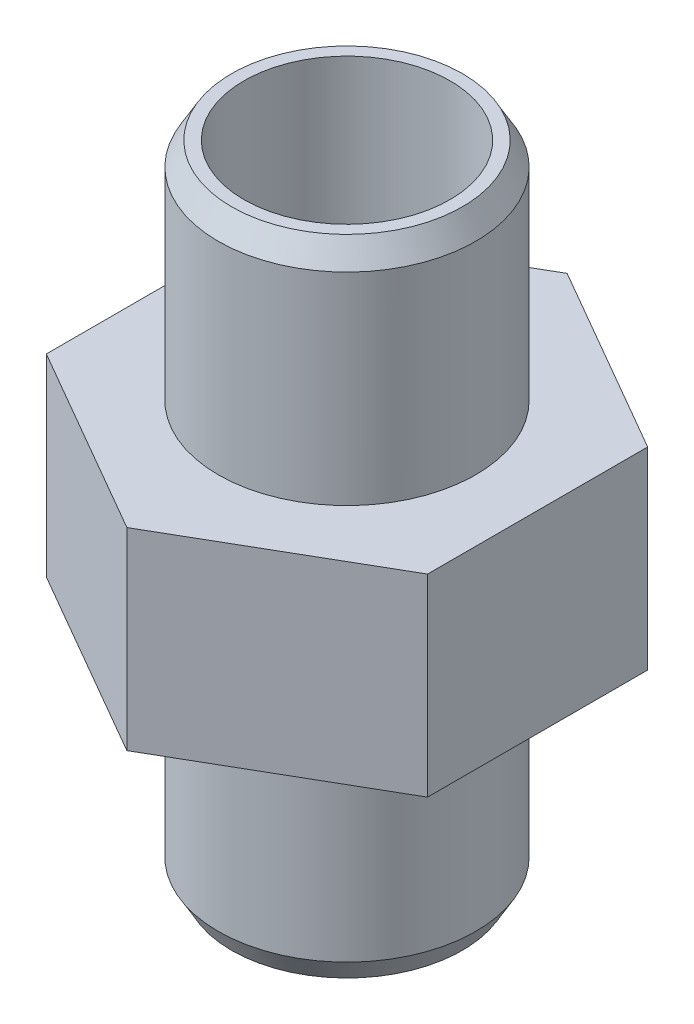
ISO-10303-21;
HEADER;
FILE_DESCRIPTION(('STEP AP214'),'2;1');
FILE_NAME('part.step','',(''),(''),'','','');
FILE_SCHEMA(('AUTOMOTIVE_DESIGN { 1 0 10303 214 1 1 1 1 }'));
ENDSEC;
DATA;
#1=APPLICATION_CONTEXT('core data for automotive mechanical design processes');
#2=APPLICATION_PROTOCOL_DEFINITION('international standard','automotive_design',2000,#1);
#3=PRODUCT_CONTEXT('',#1,'mechanical');
#4=PRODUCT('Part','Part','',(#3));
#5=PRODUCT_RELATED_PRODUCT_CATEGORY('part','',(#4));
#6=PRODUCT_DEFINITION_FORMATION('','',#4);
#7=PRODUCT_DEFINITION_CONTEXT('part definition',#1,'design');
#8=PRODUCT_DEFINITION('design','',#6,#7);
#9=PRODUCT_DEFINITION_SHAPE('','',#8);
#10=(LENGTH_UNIT() NAMED_UNIT(*) SI_UNIT(.MILLI.,.METRE.));
#11=(NAMED_UNIT(*) PLANE_ANGLE_UNIT() SI_UNIT($,.RADIAN.));
#12=(NAMED_UNIT(*) SI_UNIT($,.STERADIAN.) SOLID_ANGLE_UNIT());
#13=UNCERTAINTY_MEASURE_WITH_UNIT(LENGTH_MEASURE(1.E-05),#10,'distance_accuracy_value','');
#14=(GEOMETRIC_REPRESENTATION_CONTEXT(3) GLOBAL_UNCERTAINTY_ASSIGNED_CONTEXT((#13)) GLOBAL_UNIT_ASSIGNED_CONTEXT((#10,
#11,#12)) REPRESENTATION_CONTEXT('',''));
#15=CARTESIAN_POINT('',(0.,0.,0.));
#16=DIRECTION('',(0.,0.,1.));
#17=DIRECTION('',(1.,0.,0.));
#18=AXIS2_PLACEMENT_3D('',#15,#16,#17);
#19=CARTESIAN_POINT('',(6.35,4.7625,0.));
#20=DIRECTION('',(0.,-1.,0.));
#21=DIRECTION('',(0.,0.,-1.));
#22=AXIS2_PLACEMENT_3D('',#19,#20,#21);
#23=PLANE('',#22);
#24=CARTESIAN_POINT('',(0.,4.7625,0.));
#25=DIRECTION('',(0.,1.,0.));
#26=DIRECTION('',(0.,0.,1.));
#27=AXIS2_PLACEMENT_3D('',#24,#25,#26);
#28=CIRCLE('',#27,6.35);
#29=CARTESIAN_POINT('',(0.,4.7625,6.35));
#30=VERTEX_POINT('',#29);
#31=EDGE_CURVE('E130',#30,#30,#28,.T.);
#32=ORIENTED_EDGE('',*,*,#31,.F.);
#33=EDGE_LOOP('',(#32));
#34=FACE_BOUND('',#33,.T.);
#35=DIRECTION('',(0.866025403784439,0.,0.5));
#36=VECTOR('',#35,1.);
#37=CARTESIAN_POINT('',(-9.398,4.7625,5.4259378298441));
#38=LINE('',#37,#36);
#39=CARTESIAN_POINT('',(-9.398,4.7625,5.4259378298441));
#40=VERTEX_POINT('',#39);
#41=CARTESIAN_POINT('',(0.,4.7625,10.8518756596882));
#42=VERTEX_POINT('',#41);
#43=EDGE_CURVE('E106',#40,#42,#38,.T.);
#44=ORIENTED_EDGE('',*,*,#43,.T.);
#45=DIRECTION('',(0.866025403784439,0.,-0.5));
#46=VECTOR('',#45,1.);
#47=CARTESIAN_POINT('',(0.,4.7625,10.8518756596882));
#48=LINE('',#47,#46);
#49=CARTESIAN_POINT('',(9.398,4.7625,5.4259378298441));
#50=VERTEX_POINT('',#49);
#51=EDGE_CURVE('E104',#42,#50,#48,.T.);
#52=ORIENTED_EDGE('',*,*,#51,.T.);
#53=DIRECTION('',(0.,0.,-1.));
#54=VECTOR('',#53,1.);
#55=CARTESIAN_POINT('',(9.398,4.7625,5.4259378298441));
#56=LINE('',#55,#54);
#57=CARTESIAN_POINT('',(9.398,4.7625,-5.4259378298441));
#58=VERTEX_POINT('',#57);
#59=EDGE_CURVE('E46',#50,#58,#56,.T.);
#60=ORIENTED_EDGE('',*,*,#59,.T.);
#61=DIRECTION('',(-0.866025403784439,0.,-0.5));
#62=VECTOR('',#61,1.);
#63=CARTESIAN_POINT('',(9.398,4.7625,-5.4259378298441));
#64=LINE('',#63,#62);
#65=CARTESIAN_POINT('',(0.,4.7625,-10.8518756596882));
#66=VERTEX_POINT('',#65);
#67=EDGE_CURVE('E94',#58,#66,#64,.T.);
#68=ORIENTED_EDGE('',*,*,#67,.T.);
#69=DIRECTION('',(-0.866025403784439,0.,0.5));
#70=VECTOR('',#69,1.);
#71=CARTESIAN_POINT('',(0.,4.7625,-10.8518756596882));
#72=LINE('',#71,#70);
#73=CARTESIAN_POINT('',(-9.398,4.7625,-5.42593782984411));
#74=VERTEX_POINT('',#73);
#75=EDGE_CURVE('E100',#66,#74,#72,.T.);
#76=ORIENTED_EDGE('',*,*,#75,.T.);
#77=DIRECTION('',(0.,0.,1.));
#78=VECTOR('',#77,1.);
#79=CARTESIAN_POINT('',(-9.398,4.7625,-5.42593782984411));
#80=LINE('',#79,#78);
#81=EDGE_CURVE('E111',#74,#40,#80,.T.);
#82=ORIENTED_EDGE('',*,*,#81,.T.);
#83=EDGE_LOOP('',(#44,#52,#60,#68,#76,#82));
#84=FACE_BOUND('',#83,.T.);
#85=ADVANCED_FACE('F31',(#34,#84),#23,.F.);
#86=CARTESIAN_POINT('',(12.7,-4.7625,0.));
#87=DIRECTION('',(0.,1.,0.));
#88=DIRECTION('',(0.,0.,1.));
#89=AXIS2_PLACEMENT_3D('',#86,#87,#88);
#90=PLANE('',#89);
#91=CARTESIAN_POINT('',(0.,-4.7625,0.));
#92=DIRECTION('',(0.,1.,0.));
#93=DIRECTION('',(0.,0.,1.));
#94=AXIS2_PLACEMENT_3D('',#91,#92,#93);
#95=CIRCLE('',#94,6.35);
#96=CARTESIAN_POINT('',(0.,-4.7625,6.35));
#97=VERTEX_POINT('',#96);
#98=EDGE_CURVE('E127',#97,#97,#95,.T.);
#99=ORIENTED_EDGE('',*,*,#98,.T.);
#100=EDGE_LOOP('',(#99));
#101=FACE_BOUND('',#100,.T.);
#102=DIRECTION('',(0.866025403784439,0.,0.5));
#103=VECTOR('',#102,1.);
#104=CARTESIAN_POINT('',(4.826,-4.7625,13.6381680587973));
#105=LINE('',#104,#103);
#106=CARTESIAN_POINT('',(-9.398,-4.7625,5.4259378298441));
#107=VERTEX_POINT('',#106);
#108=CARTESIAN_POINT('',(0.,-4.7625,10.8518756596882));
#109=VERTEX_POINT('',#108);
#110=EDGE_CURVE('E142',#107,#109,#105,.T.);
#111=ORIENTED_EDGE('',*,*,#110,.F.);
#112=DIRECTION('',(0.,0.,1.));
#113=VECTOR('',#112,1.);
#114=CARTESIAN_POINT('',(-9.398,-4.7625,0.));
#115=LINE('',#114,#113);
#116=CARTESIAN_POINT('',(-9.398,-4.7625,-5.42593782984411));
#117=VERTEX_POINT('',#116);
#118=EDGE_CURVE('E140',#117,#107,#115,.T.);
#119=ORIENTED_EDGE('',*,*,#118,.F.);
#120=DIRECTION('',(-0.866025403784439,0.,0.5));
#121=VECTOR('',#120,1.);
#122=CARTESIAN_POINT('',(4.82600000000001,-4.7625,-13.6381680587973));
#123=LINE('',#122,#121);
#124=CARTESIAN_POINT('',(0.,-4.7625,-10.8518756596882));
#125=VERTEX_POINT('',#124);
#126=EDGE_CURVE('E138',#125,#117,#123,.T.);
#127=ORIENTED_EDGE('',*,*,#126,.F.);
#128=DIRECTION('',(-0.866025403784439,0.,-0.5));
#129=VECTOR('',#128,1.);
#130=CARTESIAN_POINT('',(14.224,-4.7625,-2.63964543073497));
#131=LINE('',#130,#129);
#132=CARTESIAN_POINT('',(9.398,-4.7625,-5.4259378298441));
#133=VERTEX_POINT('',#132);
#134=EDGE_CURVE('E136',#133,#125,#131,.T.);
#135=ORIENTED_EDGE('',*,*,#134,.F.);
#136=DIRECTION('',(0.,0.,-1.));
#137=VECTOR('',#136,1.);
#138=CARTESIAN_POINT('',(9.398,-4.7625,0.));
#139=LINE('',#138,#137);
#140=CARTESIAN_POINT('',(9.398,-4.7625,5.4259378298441));
#141=VERTEX_POINT('',#140);
#142=EDGE_CURVE('E87',#141,#133,#139,.T.);
#143=ORIENTED_EDGE('',*,*,#142,.F.);
#144=DIRECTION('',(0.866025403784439,0.,-0.5));
#145=VECTOR('',#144,1.);
#146=CARTESIAN_POINT('',(14.224,-4.7625,2.63964543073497));
#147=LINE('',#146,#145);
#148=EDGE_CURVE('E133',#109,#141,#147,.T.);
#149=ORIENTED_EDGE('',*,*,#148,.F.);
#150=EDGE_LOOP('',(#111,#119,#127,#135,#143,#149));
#151=FACE_BOUND('',#150,.T.);
#152=ADVANCED_FACE('F168',(#101,#151),#90,.F.);
#153=CARTESIAN_POINT('',(0.,15.875,0.));
#154=DIRECTION('',(0.,-1.,0.));
#155=DIRECTION('',(0.,0.,-1.));
#156=AXIS2_PLACEMENT_3D('',#153,#154,#155);
#157=PLANE('',#156);
#158=CARTESIAN_POINT('',(0.,15.875,0.));
#159=DIRECTION('',(0.,-1.,0.));
#160=DIRECTION('',(0.,0.,-1.));
#161=AXIS2_PLACEMENT_3D('',#158,#159,#160);
#162=CIRCLE('',#161,5.69008864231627);
#163=CARTESIAN_POINT('',(0.,15.875,-5.69008864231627));
#164=VERTEX_POINT('',#163);
#165=EDGE_CURVE('E144',#164,#164,#162,.F.);
#166=ORIENTED_EDGE('',*,*,#165,.T.);
#167=EDGE_LOOP('',(#166));
#168=FACE_BOUND('',#167,.T.);
#169=CARTESIAN_POINT('',(0.,15.875,0.));
#170=DIRECTION('',(0.,1.,0.));
#171=DIRECTION('',(0.,0.,1.));
#172=AXIS2_PLACEMENT_3D('',#169,#170,#171);
#173=CIRCLE('',#172,5.08);
#174=CARTESIAN_POINT('',(0.,15.875,5.08));
#175=VERTEX_POINT('',#174);
#176=EDGE_CURVE('E116',#175,#175,#173,.T.);
#177=ORIENTED_EDGE('',*,*,#176,.F.);
#178=EDGE_LOOP('',(#177));
#179=FACE_BOUND('',#178,.T.);
#180=ADVANCED_FACE('F33',(#168,#179),#157,.F.);
#181=CARTESIAN_POINT('',(0.,27.4512027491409,0.));
#182=DIRECTION('',(0.,1.,0.));
#183=DIRECTION('',(0.,0.,1.));
#184=AXIS2_PLACEMENT_3D('',#181,#182,#183);
#185=CYLINDRICAL_SURFACE('',#184,6.35);
#186=CARTESIAN_POINT('',(0.,14.732,0.));
#187=DIRECTION('',(0.,-1.,0.));
#188=DIRECTION('',(0.,0.,-1.));
#189=AXIS2_PLACEMENT_3D('',#186,#187,#188);
#190=CIRCLE('',#189,6.35);
#191=CARTESIAN_POINT('',(0.,14.732,-6.35));
#192=VERTEX_POINT('',#191);
#193=EDGE_CURVE('E147',#192,#192,#190,.T.);
#194=ORIENTED_EDGE('',*,*,#193,.T.);
#195=EDGE_LOOP('',(#194));
#196=FACE_BOUND('',#195,.T.);
#197=ORIENTED_EDGE('',*,*,#31,.T.);
#198=EDGE_LOOP('',(#197));
#199=FACE_BOUND('',#198,.T.);
#200=ADVANCED_FACE('F178',(#196,#199),#185,.T.);
#201=CARTESIAN_POINT('',(0.,27.4512027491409,0.));
#202=DIRECTION('',(0.,1.,0.));
#203=DIRECTION('',(0.,0.,1.));
#204=AXIS2_PLACEMENT_3D('',#201,#202,#203);
#205=CYLINDRICAL_SURFACE('',#204,6.35);
#206=CARTESIAN_POINT('',(0.,-14.732,0.));
#207=DIRECTION('',(0.,1.,0.));
#208=DIRECTION('',(0.,0.,1.));
#209=AXIS2_PLACEMENT_3D('',#206,#207,#208);
#210=CIRCLE('',#209,6.35);
#211=CARTESIAN_POINT('',(0.,-14.732,6.35));
#212=VERTEX_POINT('',#211);
#213=EDGE_CURVE('E39',#212,#212,#210,.T.);
#214=ORIENTED_EDGE('',*,*,#213,.T.);
#215=EDGE_LOOP('',(#214));
#216=FACE_BOUND('',#215,.T.);
#217=ORIENTED_EDGE('',*,*,#98,.F.);
#218=EDGE_LOOP('',(#217));
#219=FACE_BOUND('',#218,.T.);
#220=ADVANCED_FACE('F152',(#216,#219),#205,.T.);
#221=CARTESIAN_POINT('',(6.35,-15.875,0.));
#222=DIRECTION('',(0.,1.,0.));
#223=DIRECTION('',(0.,0.,1.));
#224=AXIS2_PLACEMENT_3D('',#221,#222,#223);
#225=PLANE('',#224);
#226=CARTESIAN_POINT('',(0.,-15.875,0.));
#227=DIRECTION('',(0.,1.,0.));
#228=DIRECTION('',(0.,0.,1.));
#229=AXIS2_PLACEMENT_3D('',#226,#227,#228);
#230=CIRCLE('',#229,5.69008864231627);
#231=CARTESIAN_POINT('',(0.,-15.875,5.69008864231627));
#232=VERTEX_POINT('',#231);
#233=EDGE_CURVE('E12',#232,#232,#230,.F.);
#234=ORIENTED_EDGE('',*,*,#233,.T.);
#235=EDGE_LOOP('',(#234));
#236=FACE_BOUND('',#235,.T.);
#237=CARTESIAN_POINT('',(0.,-15.875,0.));
#238=DIRECTION('',(0.,1.,0.));
#239=DIRECTION('',(0.,0.,1.));
#240=AXIS2_PLACEMENT_3D('',#237,#238,#239);
#241=CIRCLE('',#240,5.08);
#242=CARTESIAN_POINT('',(0.,-15.875,5.08));
#243=VERTEX_POINT('',#242);
#244=EDGE_CURVE('E124',#243,#243,#241,.T.);
#245=ORIENTED_EDGE('',*,*,#244,.T.);
#246=EDGE_LOOP('',(#245));
#247=FACE_BOUND('',#246,.T.);
#248=ADVANCED_FACE('F185',(#236,#247),#225,.F.);
#249=CARTESIAN_POINT('',(0.,-15.875,0.));
#250=DIRECTION('',(0.,1.,0.));
#251=DIRECTION('',(0.,0.,1.));
#252=AXIS2_PLACEMENT_3D('',#249,#250,#251);
#253=CYLINDRICAL_SURFACE('',#252,5.08);
#254=ORIENTED_EDGE('',*,*,#244,.F.);
#255=EDGE_LOOP('',(#254));
#256=FACE_BOUND('',#255,.T.);
#257=ORIENTED_EDGE('',*,*,#176,.T.);
#258=EDGE_LOOP('',(#257));
#259=FACE_BOUND('',#258,.T.);
#260=ADVANCED_FACE('F194',(#256,#259),#253,.F.);
#261=CARTESIAN_POINT('',(-9.398,-15.875,5.4259378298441));
#262=DIRECTION('',(-0.5,0.,0.866025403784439));
#263=DIRECTION('',(0.866025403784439,0.,0.5));
#264=AXIS2_PLACEMENT_3D('',#261,#262,#263);
#265=PLANE('',#264);
#266=ORIENTED_EDGE('',*,*,#110,.T.);
#267=DIRECTION('',(0.,1.,0.));
#268=VECTOR('',#267,1.);
#269=CARTESIAN_POINT('',(0.,-15.875,10.8518756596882));
#270=LINE('',#269,#268);
#271=EDGE_CURVE('E54',#109,#42,#270,.T.);
#272=ORIENTED_EDGE('',*,*,#271,.T.);
#273=ORIENTED_EDGE('',*,*,#43,.F.);
#274=DIRECTION('',(0.,1.,0.));
#275=VECTOR('',#274,1.);
#276=CARTESIAN_POINT('',(-9.398,-15.875,5.4259378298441));
#277=LINE('',#276,#275);
#278=EDGE_CURVE('E114',#107,#40,#277,.T.);
#279=ORIENTED_EDGE('',*,*,#278,.F.);
#280=EDGE_LOOP('',(#266,#272,#273,#279));
#281=FACE_BOUND('',#280,.T.);
#282=ADVANCED_FACE('F196',(#281),#265,.T.);
#283=CARTESIAN_POINT('',(-9.398,-15.875,-5.42593782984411));
#284=DIRECTION('',(-1.,0.,0.));
#285=DIRECTION('',(0.,0.,1.));
#286=AXIS2_PLACEMENT_3D('',#283,#284,#285);
#287=PLANE('',#286);
#288=ORIENTED_EDGE('',*,*,#118,.T.);
#289=ORIENTED_EDGE('',*,*,#278,.T.);
#290=ORIENTED_EDGE('',*,*,#81,.F.);
#291=DIRECTION('',(0.,1.,0.));
#292=VECTOR('',#291,1.);
#293=CARTESIAN_POINT('',(-9.398,-15.875,-5.42593782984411));
#294=LINE('',#293,#292);
#295=EDGE_CURVE('E117',#117,#74,#294,.T.);
#296=ORIENTED_EDGE('',*,*,#295,.F.);
#297=EDGE_LOOP('',(#288,#289,#290,#296));
#298=FACE_BOUND('',#297,.T.);
#299=ADVANCED_FACE('F203',(#298),#287,.T.);
#300=CARTESIAN_POINT('',(0.,-15.875,-10.8518756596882));
#301=DIRECTION('',(-0.5,0.,-0.866025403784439));
#302=DIRECTION('',(-0.866025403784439,0.,0.5));
#303=AXIS2_PLACEMENT_3D('',#300,#301,#302);
#304=PLANE('',#303);
#305=ORIENTED_EDGE('',*,*,#126,.T.);
#306=ORIENTED_EDGE('',*,*,#295,.T.);
#307=ORIENTED_EDGE('',*,*,#75,.F.);
#308=DIRECTION('',(0.,1.,0.));
#309=VECTOR('',#308,1.);
#310=CARTESIAN_POINT('',(0.,-15.875,-10.8518756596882));
#311=LINE('',#310,#309);
#312=EDGE_CURVE('E90',#125,#66,#311,.T.);
#313=ORIENTED_EDGE('',*,*,#312,.F.);
#314=EDGE_LOOP('',(#305,#306,#307,#313));
#315=FACE_BOUND('',#314,.T.);
#316=ADVANCED_FACE('F216',(#315),#304,.T.);
#317=CARTESIAN_POINT('',(9.398,-15.875,-5.4259378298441));
#318=DIRECTION('',(0.5,0.,-0.866025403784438));
#319=DIRECTION('',(-0.866025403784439,0.,-0.5));
#320=AXIS2_PLACEMENT_3D('',#317,#318,#319);
#321=PLANE('',#320);
#322=ORIENTED_EDGE('',*,*,#134,.T.);
#323=ORIENTED_EDGE('',*,*,#312,.T.);
#324=ORIENTED_EDGE('',*,*,#67,.F.);
#325=DIRECTION('',(0.,1.,0.));
#326=VECTOR('',#325,1.);
#327=CARTESIAN_POINT('',(9.398,-15.875,-5.4259378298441));
#328=LINE('',#327,#326);
#329=EDGE_CURVE('E83',#133,#58,#328,.T.);
#330=ORIENTED_EDGE('',*,*,#329,.F.);
#331=EDGE_LOOP('',(#322,#323,#324,#330));
#332=FACE_BOUND('',#331,.T.);
#333=ADVANCED_FACE('F95',(#332),#321,.T.);
#334=CARTESIAN_POINT('',(9.398,-15.875,5.4259378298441));
#335=DIRECTION('',(1.,0.,0.));
#336=DIRECTION('',(0.,0.,-1.));
#337=AXIS2_PLACEMENT_3D('',#334,#335,#336);
#338=PLANE('',#337);
#339=ORIENTED_EDGE('',*,*,#142,.T.);
#340=ORIENTED_EDGE('',*,*,#329,.T.);
#341=ORIENTED_EDGE('',*,*,#59,.F.);
#342=DIRECTION('',(0.,1.,0.));
#343=VECTOR('',#342,1.);
#344=CARTESIAN_POINT('',(9.398,-15.875,5.4259378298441));
#345=LINE('',#344,#343);
#346=EDGE_CURVE('E91',#141,#50,#345,.T.);
#347=ORIENTED_EDGE('',*,*,#346,.F.);
#348=EDGE_LOOP('',(#339,#340,#341,#347));
#349=FACE_BOUND('',#348,.T.);
#350=ADVANCED_FACE('F85',(#349),#338,.T.);
#351=CARTESIAN_POINT('',(0.,-15.875,10.8518756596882));
#352=DIRECTION('',(0.5,0.,0.866025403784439));
#353=DIRECTION('',(0.866025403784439,0.,-0.5));
#354=AXIS2_PLACEMENT_3D('',#351,#352,#353);
#355=PLANE('',#354);
#356=ORIENTED_EDGE('',*,*,#148,.T.);
#357=ORIENTED_EDGE('',*,*,#346,.T.);
#358=ORIENTED_EDGE('',*,*,#51,.F.);
#359=ORIENTED_EDGE('',*,*,#271,.F.);
#360=EDGE_LOOP('',(#356,#357,#358,#359));
#361=FACE_BOUND('',#360,.T.);
#362=ADVANCED_FACE('F163',(#361),#355,.T.);
#363=CARTESIAN_POINT('',(0.,15.875,0.));
#364=DIRECTION('',(0.,-1.,0.));
#365=DIRECTION('',(0.,0.,-1.));
#366=AXIS2_PLACEMENT_3D('',#363,#364,#365);
#367=CONICAL_SURFACE('',#366,5.69008864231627,0.523598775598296);
#368=ORIENTED_EDGE('',*,*,#193,.F.);
#369=EDGE_LOOP('',(#368));
#370=FACE_BOUND('',#369,.T.);
#371=ORIENTED_EDGE('',*,*,#165,.F.);
#372=EDGE_LOOP('',(#371));
#373=FACE_BOUND('',#372,.T.);
#374=ADVANCED_FACE('F157',(#370,#373),#367,.T.);
#375=CARTESIAN_POINT('',(0.,-14.732,0.));
#376=DIRECTION('',(0.,1.,0.));
#377=DIRECTION('',(0.,0.,1.));
#378=AXIS2_PLACEMENT_3D('',#375,#376,#377);
#379=CONICAL_SURFACE('',#378,6.35,0.523598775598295);
#380=ORIENTED_EDGE('',*,*,#233,.F.);
#381=EDGE_LOOP('',(#380));
#382=FACE_BOUND('',#381,.T.);
#383=ORIENTED_EDGE('',*,*,#213,.F.);
#384=EDGE_LOOP('',(#383));
#385=FACE_BOUND('',#384,.T.);
#386=ADVANCED_FACE('F155',(#382,#385),#379,.T.);
#387=CLOSED_SHELL('',(#85,#152,#180,#200,#220,#248,#260,#282,#299,#316,#333,#350,#362,#374,#386));
#388=MANIFOLD_SOLID_BREP('B2',#387);
#389=ADVANCED_BREP_SHAPE_REPRESENTATION('',(#18,#388),#14);
#390=SHAPE_DEFINITION_REPRESENTATION(#9,#389);
ENDSEC;
END-ISO-10303-21;
